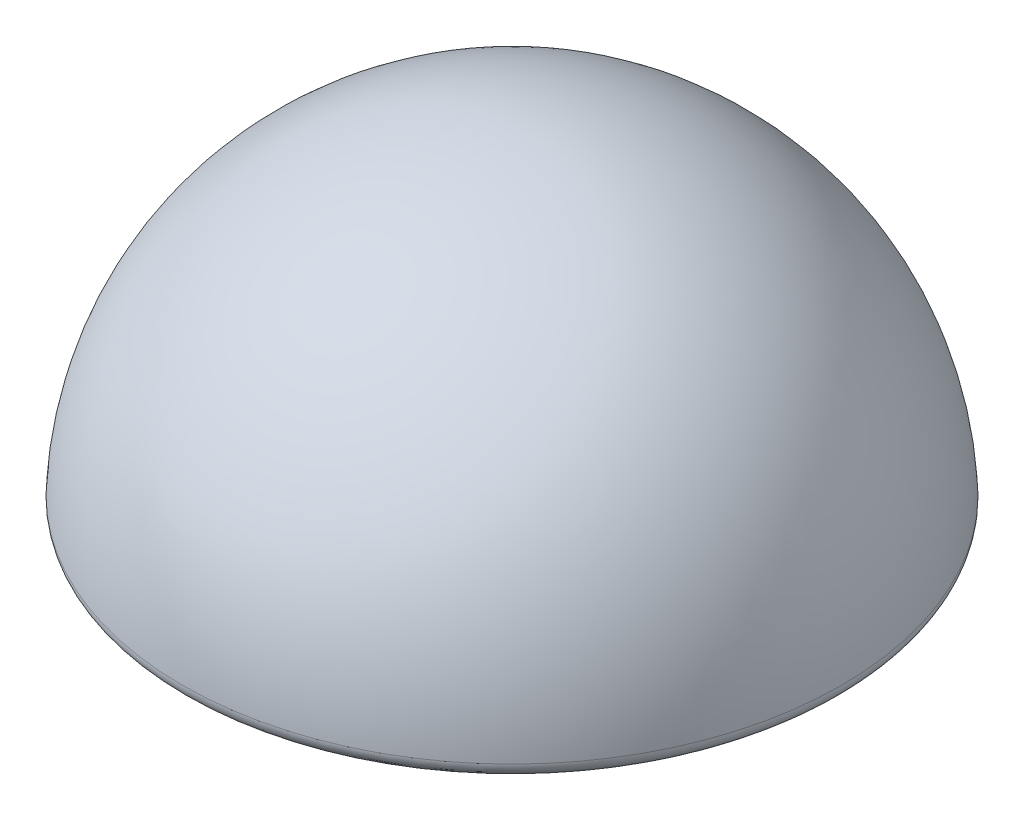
from build123d import *

# Parameters (mm, degrees)
SKETCH2_R          = 12.25
CUT_EXTRUDE1_DEPTH = 16
FILLET3_R          = 2


with BuildPart() as part:
    # Sketch1 → Revolve1 (revolve)
    with BuildSketch(Plane.XY):
        with BuildLine():
            Line((0, 0), (0, 45))
            ThreePointArc((0, 45), (31.819805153, 31.819805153), (45, 0))
            Line((45, 0), (0, 0))
        make_face()
    revolve(axis=Axis((0, 0, 0), (0, 1, 0)))

    # Sketch2 → Cut-Extrude1 (cut)
    with BuildSketch(Plane.XZ):
        with Locations(Location((0, 0, 0), (0, 0, 270))):
            Circle(SKETCH2_R)
    extrude(amount=-CUT_EXTRUDE1_DEPTH, mode=Mode.SUBTRACT)

    # Fillet3
    fillet3_edges = [part.edges().sort_by_distance(p)[0] for p in [
        (-45, 0, 0),
    ]]
    fillet(fillet3_edges, radius=FILLET3_R)


solid = part.part
